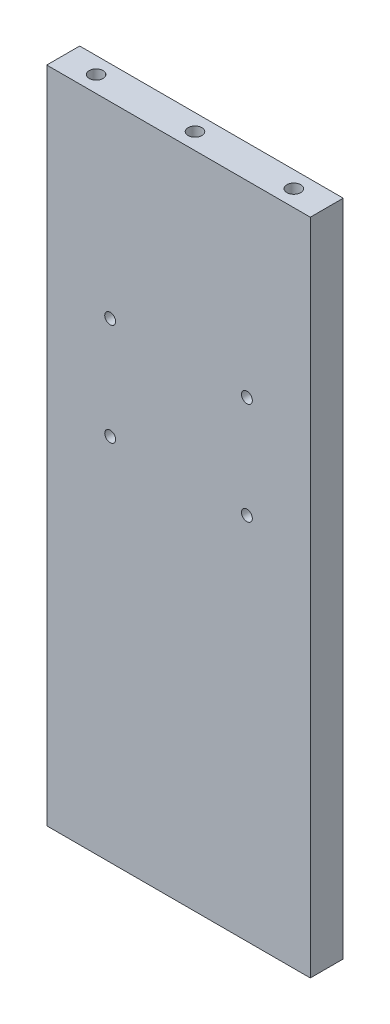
from build123d import *

# Parameters (mm, degrees)
SKETCH_1_W            = 80
SKETCH_1_H            = 200
EXTRUDE_1_DEPTH       = 10
HOLE_WIZARD_M41_D     = 3.3
HOLE_WIZARD_M52_D     = 4.2
HOLE_WIZARD_M52_DEPTH = 12
HOLE_WIZARD_M52_TIP   = 1.2618073
HOLE_WIZARD_M53_D     = 4.2
HOLE_WIZARD_M53_DEPTH = 12
HOLE_WIZARD_M53_TIP   = 1.2618073


with BuildPart() as part:
    # Sketch 1 → Extrude 1 (new body)
    with BuildSketch(Plane.XY):
        Rectangle(SKETCH_1_W, SKETCH_1_H)
    extrude(amount=EXTRUDE_1_DEPTH)

    # Hole Wizard M41 (through all)
    with Locations(Plane.XY.offset(10)):
        with Locations((-20.75, 43), (20.75, 43), (20.75, 12), (-20.75, 12)):
            Hole(HOLE_WIZARD_M41_D / 2)

    # Hole Wizard M52
    with Locations(Plane(origin=(0, 100, 0), x_dir=(1, 0, 0), z_dir=(0, 1, 0))):
        with Locations((-30, -5), (0, -5), (30, -5)):
            Hole(HOLE_WIZARD_M52_D / 2, depth=HOLE_WIZARD_M52_DEPTH)
            with Locations((0, 0, -(HOLE_WIZARD_M52_DEPTH + HOLE_WIZARD_M52_TIP / 2))):  # 118° drill point
                Cone(0, HOLE_WIZARD_M52_D / 2, HOLE_WIZARD_M52_TIP, mode=Mode.SUBTRACT)

    # Hole Wizard M53
    with Locations(Plane(origin=(0, -100, 0), x_dir=(-1, 0, 0), z_dir=(0, -1, 0))):
        with Locations((30, -5), (0, -5), (-30, -5)):
            Hole(HOLE_WIZARD_M53_D / 2, depth=HOLE_WIZARD_M53_DEPTH)
            with Locations((0, 0, -(HOLE_WIZARD_M53_DEPTH + HOLE_WIZARD_M53_TIP / 2))):  # 118° drill point
                Cone(0, HOLE_WIZARD_M53_D / 2, HOLE_WIZARD_M53_TIP, mode=Mode.SUBTRACT)


solid = part.part
